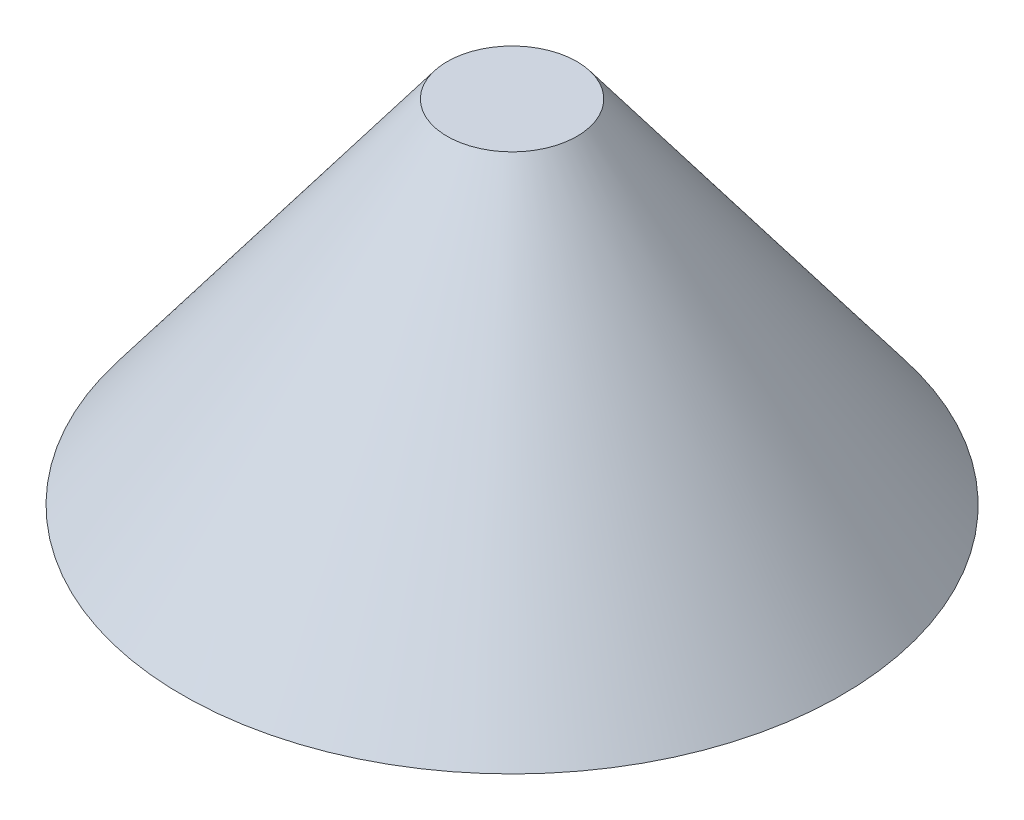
ISO-10303-21;
HEADER;
FILE_DESCRIPTION(('STEP AP214'),'2;1');
FILE_NAME('part.step','',(''),(''),'','','');
FILE_SCHEMA(('AUTOMOTIVE_DESIGN { 1 0 10303 214 1 1 1 1 }'));
ENDSEC;
DATA;
#1=APPLICATION_CONTEXT('core data for automotive mechanical design processes');
#2=APPLICATION_PROTOCOL_DEFINITION('international standard','automotive_design',2000,#1);
#3=PRODUCT_CONTEXT('',#1,'mechanical');
#4=PRODUCT('Part','Part','',(#3));
#5=PRODUCT_RELATED_PRODUCT_CATEGORY('part','',(#4));
#6=PRODUCT_DEFINITION_FORMATION('','',#4);
#7=PRODUCT_DEFINITION_CONTEXT('part definition',#1,'design');
#8=PRODUCT_DEFINITION('design','',#6,#7);
#9=PRODUCT_DEFINITION_SHAPE('','',#8);
#10=(LENGTH_UNIT() NAMED_UNIT(*) SI_UNIT(.MILLI.,.METRE.));
#11=(NAMED_UNIT(*) PLANE_ANGLE_UNIT() SI_UNIT($,.RADIAN.));
#12=(NAMED_UNIT(*) SI_UNIT($,.STERADIAN.) SOLID_ANGLE_UNIT());
#13=UNCERTAINTY_MEASURE_WITH_UNIT(LENGTH_MEASURE(1.E-05),#10,'distance_accuracy_value','');
#14=(GEOMETRIC_REPRESENTATION_CONTEXT(3) GLOBAL_UNCERTAINTY_ASSIGNED_CONTEXT((#13)) GLOBAL_UNIT_ASSIGNED_CONTEXT((#10,
#11,#12)) REPRESENTATION_CONTEXT('',''));
#15=CARTESIAN_POINT('',(0.,0.,0.));
#16=DIRECTION('',(0.,0.,1.));
#17=DIRECTION('',(1.,0.,0.));
#18=AXIS2_PLACEMENT_3D('',#15,#16,#17);
#19=CARTESIAN_POINT('',(0.,0.,0.));
#20=DIRECTION('',(0.,1.,0.));
#21=DIRECTION('',(0.,0.,1.));
#22=AXIS2_PLACEMENT_3D('',#19,#20,#21);
#23=PLANE('',#22);
#24=CARTESIAN_POINT('',(0.,0.,0.));
#25=DIRECTION('',(0.,1.,0.));
#26=DIRECTION('',(0.,0.,1.));
#27=AXIS2_PLACEMENT_3D('',#24,#25,#26);
#28=CIRCLE('',#27,95.3483515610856);
#29=CARTESIAN_POINT('',(0.,0.,-95.3483515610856));
#30=VERTEX_POINT('',#29);
#31=EDGE_CURVE('E10',#30,#30,#28,.T.);
#32=ORIENTED_EDGE('',*,*,#31,.F.);
#33=EDGE_LOOP('',(#32));
#34=FACE_BOUND('',#33,.T.);
#35=ADVANCED_FACE('F29',(#34),#23,.F.);
#36=CARTESIAN_POINT('',(0.,0.,0.));
#37=DIRECTION('',(0.,-1.,0.));
#38=DIRECTION('',(0.,0.,-1.));
#39=AXIS2_PLACEMENT_3D('',#36,#37,#38);
#40=CONICAL_SURFACE('',#39,95.3483515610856,0.645391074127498);
#41=CARTESIAN_POINT('',(0.,101.707369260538,0.));
#42=DIRECTION('',(0.,1.,0.));
#43=DIRECTION('',(0.,0.,1.));
#44=AXIS2_PLACEMENT_3D('',#41,#42,#43);
#45=CIRCLE('',#44,18.7670488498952);
#46=CARTESIAN_POINT('',(0.,101.707369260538,-18.7670488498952));
#47=VERTEX_POINT('',#46);
#48=EDGE_CURVE('E35',#47,#47,#45,.T.);
#49=CARTESIAN_POINT('',(0.,101.707369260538,-18.7670488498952));
#50=CARTESIAN_POINT('',(0.,100.647917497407,-19.5647707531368));
#51=CARTESIAN_POINT('',(0.,99.5884657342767,-20.3624926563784));
#52=CARTESIAN_POINT('',(0.,97.4695622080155,-21.9579364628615));
#53=CARTESIAN_POINT('',(0.,96.4101104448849,-22.755658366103));
#54=CARTESIAN_POINT('',(0.,94.2912069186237,-24.3511021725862));
#55=CARTESIAN_POINT('',(0.,93.2317551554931,-25.1488240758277));
#56=CARTESIAN_POINT('',(0.,91.1128516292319,-26.7442678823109));
#57=CARTESIAN_POINT('',(0.,90.0533998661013,-27.5419897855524));
#58=CARTESIAN_POINT('',(0.,87.9344963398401,-29.1374335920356));
#59=CARTESIAN_POINT('',(0.,86.8750445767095,-29.9351554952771));
#60=CARTESIAN_POINT('',(0.,84.7561410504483,-31.5305993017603));
#61=CARTESIAN_POINT('',(0.,83.6966892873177,-32.3283212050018));
#62=CARTESIAN_POINT('',(0.,81.5777857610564,-33.923765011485));
#63=CARTESIAN_POINT('',(0.,80.5183339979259,-34.7214869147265));
#64=CARTESIAN_POINT('',(0.,78.3994304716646,-36.3169307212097));
#65=CARTESIAN_POINT('',(0.,77.339978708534,-37.1146526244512));
#66=CARTESIAN_POINT('',(0.,75.2210751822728,-38.7100964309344));
#67=CARTESIAN_POINT('',(0.,74.1616234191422,-39.5078183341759));
#68=CARTESIAN_POINT('',(0.,72.042719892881,-41.1032621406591));
#69=CARTESIAN_POINT('',(0.,70.9832681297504,-41.9009840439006));
#70=CARTESIAN_POINT('',(0.,68.8643646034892,-43.4964278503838));
#71=CARTESIAN_POINT('',(0.,67.8049128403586,-44.2941497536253));
#72=CARTESIAN_POINT('',(0.,65.6860093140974,-45.8895935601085));
#73=CARTESIAN_POINT('',(0.,64.6265575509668,-46.68731546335));
#74=CARTESIAN_POINT('',(0.,62.5076540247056,-48.2827592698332));
#75=CARTESIAN_POINT('',(0.,61.448202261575,-49.0804811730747));
#76=CARTESIAN_POINT('',(0.,59.3292987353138,-50.6759249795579));
#77=CARTESIAN_POINT('',(0.,58.2698469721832,-51.4736468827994));
#78=CARTESIAN_POINT('',(0.,56.150943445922,-53.0690906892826));
#79=CARTESIAN_POINT('',(0.,55.0914916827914,-53.8668125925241));
#80=CARTESIAN_POINT('',(0.,52.9725881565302,-55.4622563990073));
#81=CARTESIAN_POINT('',(0.,51.9131363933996,-56.2599783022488));
#82=CARTESIAN_POINT('',(0.,49.7942328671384,-57.855422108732));
#83=CARTESIAN_POINT('',(0.,48.7347811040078,-58.6531440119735));
#84=CARTESIAN_POINT('',(0.,46.6158775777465,-60.2485878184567));
#85=CARTESIAN_POINT('',(0.,45.5564258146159,-61.0463097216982));
#86=CARTESIAN_POINT('',(0.,43.4375222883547,-62.6417535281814));
#87=CARTESIAN_POINT('',(0.,42.3780705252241,-63.4394754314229));
#88=CARTESIAN_POINT('',(0.,40.2591669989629,-65.0349192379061));
#89=CARTESIAN_POINT('',(0.,39.1997152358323,-65.8326411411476));
#90=CARTESIAN_POINT('',(0.,37.0808117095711,-67.4280849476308));
#91=CARTESIAN_POINT('',(0.,36.0213599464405,-68.2258068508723));
#92=CARTESIAN_POINT('',(0.,33.9024564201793,-69.8212506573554));
#93=CARTESIAN_POINT('',(0.,32.8430046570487,-70.618972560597));
#94=CARTESIAN_POINT('',(0.,30.7241011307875,-72.2144163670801));
#95=CARTESIAN_POINT('',(0.,29.6646493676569,-73.0121382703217));
#96=CARTESIAN_POINT('',(0.,27.5457458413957,-74.6075820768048));
#97=CARTESIAN_POINT('',(0.,26.4862940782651,-75.4053039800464));
#98=CARTESIAN_POINT('',(0.,24.3673905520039,-77.0007477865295));
#99=CARTESIAN_POINT('',(0.,23.3079387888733,-77.7984696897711));
#100=CARTESIAN_POINT('',(0.,21.1890352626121,-79.3939134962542));
#101=CARTESIAN_POINT('',(0.,20.1295834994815,-80.1916353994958));
#102=CARTESIAN_POINT('',(0.,18.0106799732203,-81.7870792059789));
#103=CARTESIAN_POINT('',(0.,16.9512282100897,-82.5848011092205));
#104=CARTESIAN_POINT('',(0.,14.8323246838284,-84.1802449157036));
#105=CARTESIAN_POINT('',(0.,13.7728729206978,-84.9779668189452));
#106=CARTESIAN_POINT('',(0.,11.6539693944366,-86.5734106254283));
#107=CARTESIAN_POINT('',(0.,10.594517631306,-87.3711325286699));
#108=CARTESIAN_POINT('',(0.,8.47561410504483,-88.966576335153));
#109=CARTESIAN_POINT('',(0.,7.41616234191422,-89.7642982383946));
#110=CARTESIAN_POINT('',(0.,5.29725881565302,-91.3597420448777));
#111=CARTESIAN_POINT('',(0.,4.23780705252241,-92.1574639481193));
#112=CARTESIAN_POINT('',(0.,2.11890352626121,-93.7529077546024));
#113=CARTESIAN_POINT('',(0.,1.0594517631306,-94.550629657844));
#114=CARTESIAN_POINT('',(0.,0.,-95.3483515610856));
#115=B_SPLINE_CURVE_WITH_KNOTS('',3,(#49,#50,#51,#52,#53,#54,#55,#56,#57,#58,#59,#60,#61,#62,
#63,#64,#65,#66,#67,#68,#69,#70,#71,#72,#73,#74,#75,#76,#77,#78,#79,#80,#81,#82,#83,#84,#85,#86,
#87,#88,#89,#90,#91,#92,#93,#94,#95,#96,#97,#98,#99,#100,#101,#102,#103,#104,#105,#106,#107,
#108,#109,#110,#111,#112,#113,#114),.UNSPECIFIED.,.F.,.F.,(4,2,2,2,2,2,2,2,2,2,2,2,2,2,2,2,2,2,
2,2,2,2,2,2,2,2,2,2,2,2,2,2,4),(0.,3.97859076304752,7.95718152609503,11.9357722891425,
15.9143630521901,19.8929538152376,23.8715445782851,27.8501353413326,31.8287261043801,
35.8073168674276,39.7859076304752,43.7644983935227,47.7430891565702,51.7216799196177,
55.7002706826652,59.6788614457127,63.6574522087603,67.6360429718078,71.6146337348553,
75.5932244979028,79.5718152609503,83.5504060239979,87.5289967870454,91.5075875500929,
95.4861783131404,99.4647690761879,103.443359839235,107.421950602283,111.40054136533,
115.379132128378,119.357722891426,123.336313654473,127.314904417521),.UNSPECIFIED.);
#116=EDGE_CURVE('BSEAM43',#47,#30,#115,.T.);
#117=ORIENTED_EDGE('',*,*,#48,.F.);
#118=ORIENTED_EDGE('',*,*,#31,.T.);
#119=ORIENTED_EDGE('',*,*,#116,.T.);
#120=ORIENTED_EDGE('',*,*,#116,.F.);
#121=EDGE_LOOP('',(#117,#119,#118,#120));
#122=FACE_BOUND('',#121,.T.);
#123=ADVANCED_FACE('F43',(#122),#40,.T.);
#124=CARTESIAN_POINT('',(18.7670488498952,101.707369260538,0.));
#125=DIRECTION('',(0.,-1.,0.));
#126=DIRECTION('',(0.,0.,-1.));
#127=AXIS2_PLACEMENT_3D('',#124,#125,#126);
#128=PLANE('',#127);
#129=ORIENTED_EDGE('',*,*,#48,.T.);
#130=EDGE_LOOP('',(#129));
#131=FACE_BOUND('',#130,.T.);
#132=ADVANCED_FACE('F41',(#131),#128,.F.);
#133=CLOSED_SHELL('',(#35,#123,#132));
#134=MANIFOLD_SOLID_BREP('B2',#133);
#135=ADVANCED_BREP_SHAPE_REPRESENTATION('',(#18,#134),#14);
#136=SHAPE_DEFINITION_REPRESENTATION(#9,#135);
ENDSEC;
END-ISO-10303-21;
